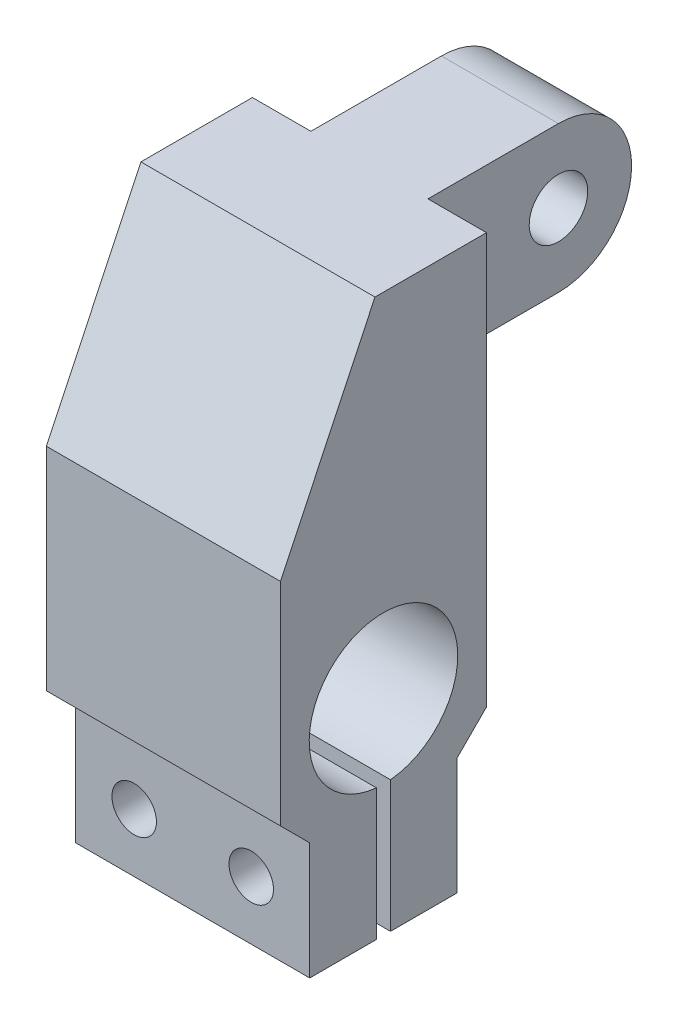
from build123d import *

# Parameters (mm, degrees)
SKETCH1_W           = 25.4
SKETCH1_H           = 60.452
BASE_EXTRUDE_DEPTH  = 22.352
SKETCH2_R           = 8.061180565
CUT_EXTRUDE1_DEPTH  = 70.27637554
SKETCH3_W           = 1.524
SKETCH3_H           = 19.148236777
CUT_EXTRUDE2_DEPTH  = 70.27637554
SKETCH4_W           = 12.7
SKETCH4_H           = 15.875
BOSS_EXTRUDE1_DEPTH = 22.098
CUT_EXTRUDE3_DEPTH  = 68.208323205
SKETCH6_R           = 3.175
CUT_EXTRUDE4_DEPTH  = 68.208323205
SKETCH7_R           = 2.413
CUT_EXTRUDE5_DEPTH  = 78.480513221


with BuildPart() as part:
    # Sketch1 → Base-Extrude (new body)
    with BuildSketch(Plane.XY):
        with Locations((12.7, 30.226)):
            Rectangle(SKETCH1_W, SKETCH1_H)
    extrude(amount=BASE_EXTRUDE_DEPTH)

    # Sketch2 → Cut-Extrude1 (cut, through all)
    with BuildSketch(Plane(origin=(25.4, 0, 0), x_dir=(0, 0, -1), z_dir=(1, 0, 0))):
        with Locations((-11.176, 22.2758)):
            Circle(SKETCH2_R)
        Polygon((-12.976616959, 58.602895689), (-27.737216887, 27.51714444), (-27.737216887, 21.260216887), (-19.177, 12.7), (-19.177, -3.689807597), (-33.809681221, -3.689807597), (-35.059393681, 61.697381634), (-11.507247, 61.697381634), (-10.844753, 61.697381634), (12.707393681, 61.697381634), (11.457681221, -3.689807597), (-3.175, -3.689807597), (-3.175, 12.7), (1.743714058, 17.618714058), (1.743714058, 61.088504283), (-11.796363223, 61.088504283), align=None)
    extrude(amount=-CUT_EXTRUDE1_DEPTH, mode=Mode.SUBTRACT)

    # Sketch3 → Cut-Extrude2 (cut, through all)
    with BuildSketch(Plane(origin=(25.4, 0, 0), x_dir=(0, 0, -1), z_dir=(1, 0, 0))):
        with Locations((-11.176, 6.300881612)):
            Rectangle(SKETCH3_W, SKETCH3_H)
    extrude(amount=-CUT_EXTRUDE2_DEPTH, mode=Mode.SUBTRACT)

    # Sketch4 → Boss-Extrude1 (add)
    with BuildSketch(Plane(origin=(0, 0, 0), x_dir=(-1, 0, 0), z_dir=(0, 0, -1))):
        with Locations((-12.7, 52.5145)):
            Rectangle(SKETCH4_W, SKETCH4_H)
    extrude(amount=BOSS_EXTRUDE1_DEPTH)

    # Sketch5 → Cut-Extrude3 (cut, through all)
    with BuildSketch(Plane(origin=(19.05, 0, 0), x_dir=(0, 0, -1), z_dir=(1, 0, 0))):
        with BuildLine():
            Line((14.1605, 44.577), (14.1605, 41.009537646))
            Line((14.1605, 41.009537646), (23.022692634, 41.009537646))
            Line((23.022692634, 41.009537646), (23.022692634, 62.415614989))
            Line((23.022692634, 62.415614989), (14.1605, 62.415614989))
            Line((14.1605, 62.415614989), (14.1605, 60.452))
            ThreePointArc((14.1605, 60.452), (22.098, 52.5145), (14.1605, 44.577))
        make_face()
    extrude(amount=-CUT_EXTRUDE3_DEPTH, mode=Mode.SUBTRACT)

    # Sketch6 → Cut-Extrude4 (cut, through all)
    with BuildSketch(Plane(origin=(19.05, 0, 0), x_dir=(0, 0, -1), z_dir=(1, 0, 0))):
        with Locations(Location((14.1605, 52.5145, 0), (0, 0, 90))):
            Circle(SKETCH6_R)
    extrude(amount=-CUT_EXTRUDE4_DEPTH, mode=Mode.SUBTRACT)

    # Sketch7 → Cut-Extrude5 (cut, through all)
    with BuildSketch(Plane.XY.offset(19.177)):
        with Locations((19.05, 6.35)):
            Circle(SKETCH7_R)
        with Locations((6.35, 6.35)):
            Circle(SKETCH7_R)
    extrude(amount=-CUT_EXTRUDE5_DEPTH, mode=Mode.SUBTRACT)


solid = part.part
